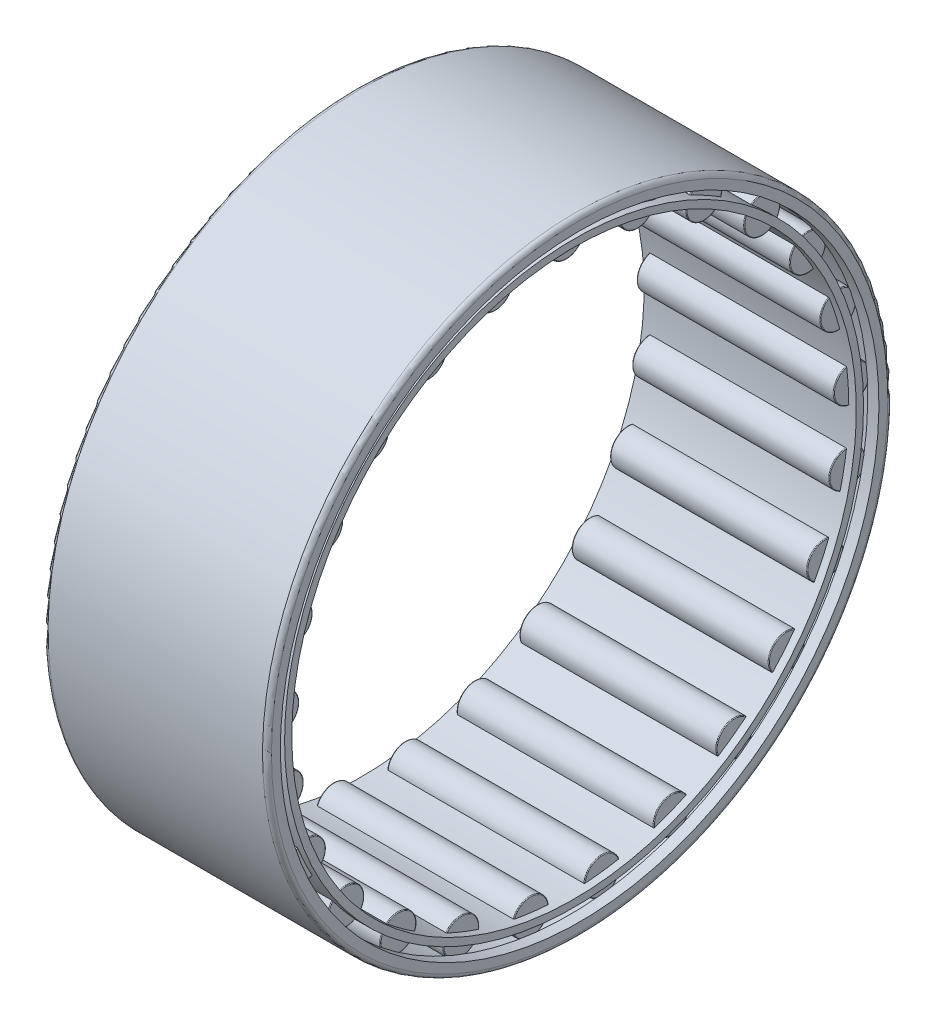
from build123d import *

# Parameters (mm, degrees)
CAGSPISKE_W           = 30.1625
CAGSPISKE_H           = 1.02108
ROLLERSDETAILED_COUNT = 25
ROLLERSDETAILED_ANGLE = 345.6


with BuildPart() as part:
    # InnRacSke → Race (revolve)
    with BuildSketch(Plane.XY):
        with BuildLine():
            Line((-14.2875, 42.545), (-15.875, 42.545))
            Line((-15.875, 42.545), (-15.875, 43.815))
            ThreePointArc((-15.875, 43.815), (-15.689012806, 44.264012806), (-15.24, 44.45))
            Line((-15.24, 44.45), (15.24, 44.45))
            ThreePointArc((15.24, 44.45), (15.689012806, 44.264012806), (15.875, 43.815))
            Line((15.875, 43.815), (15.875, 42.545))
            Line((15.875, 42.545), (14.2875, 42.545))
            Line((14.2875, 42.545), (14.2875, 43.18))
            Line((14.2875, 43.18), (-14.2875, 43.18))
            Line((-14.2875, 43.18), (-14.2875, 42.545))
        make_face()
    revolve(axis=Axis((-31.75, 0, 0), (1, 0, 0)))

    # RolDetSke → RollerDetailed (revolve)
    with BuildSketch(Plane.XY, mode=Mode.PRIVATE) as rollerdetailed_sk:
        with BuildLine():
            Line((-14.00175, 43.090592), (-14.00175, 40.64))
            Line((-14.00175, 40.64), (14.00175, 40.64))
            Line((14.00175, 40.64), (14.00175, 43.090592))
            ThreePointArc((14.00175, 43.090592), (13.971843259, 43.162793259), (13.899642, 43.1927))
            Line((13.899642, 43.1927), (-13.899642, 43.1927))
            ThreePointArc((-13.899642, 43.1927), (-13.971843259, 43.162793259), (-14.00175, 43.090592))
        make_face()
    rollerdetailed = revolve(rollerdetailed_sk.sketch.rotate(Axis((-28.575, 40.64, 0), (1, 0, 0)), 270), axis=Axis((-28.575, 40.64, 0), (1, 0, 0)))

    # CagSpiSke → CageSpine (revolve)
    with BuildSketch(Plane.XY, mode=Mode.PRIVATE) as cagespine_sk:
        with Locations((0, 40.64)):
            Rectangle(CAGSPISKE_W, CAGSPISKE_H)
    revolve(cagespine_sk.sketch.rotate(Axis((-31.75, 0, 0), (1, 0, 0)), 90), axis=Axis((-31.75, 0, 0), (1, 0, 0)))

    # RollersDetailed: RollerDetailed ×25 about axis
    rollersdetailed_axis = Axis((-50, 0, 0), (1, 0, 0))
    for i in range(1, ROLLERSDETAILED_COUNT):
        add(rollerdetailed.rotate(rollersdetailed_axis, i * ROLLERSDETAILED_ANGLE / (ROLLERSDETAILED_COUNT - 1)))


solid = part.part
